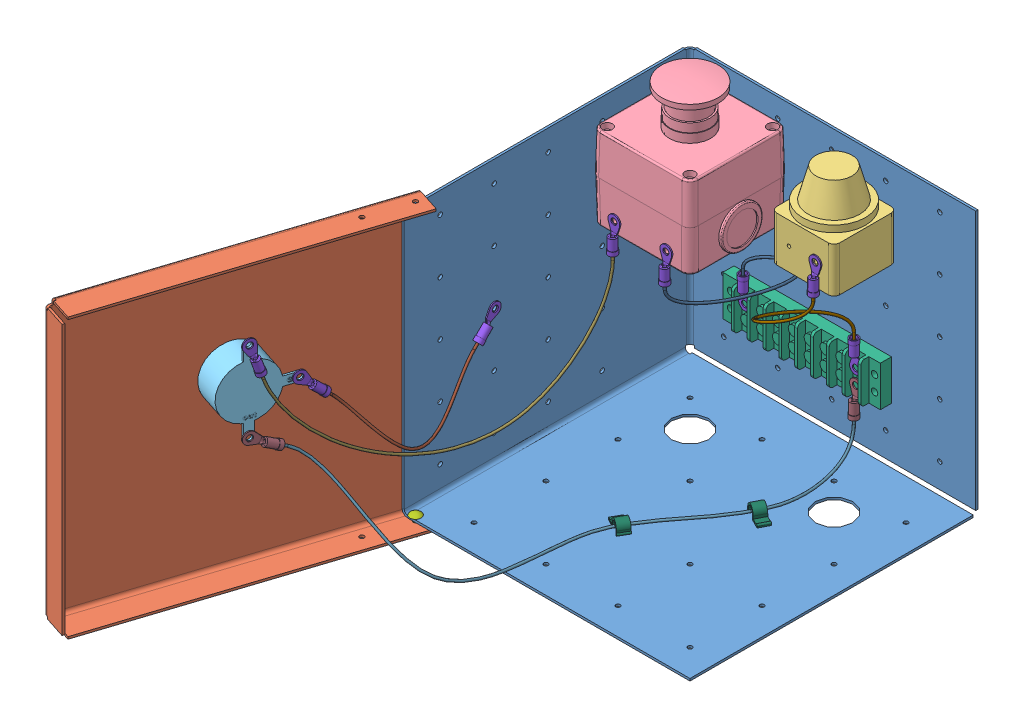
SolidWorks assembly Top Down.SLDASM, configuration Default (file format 13000). Lengths in mm.
Overall size (269.46 226.95 396.47).
29 component instances, 15 part files, 17 mates.
Components (placement in the parent):
- box10-1: box10.SLDPRT [Default] at origin size (203.2 186.37 203.2)
- cover_10-1: cover_10.SLDPRT [Default] at (96.159 -1254.76 -104.6335) x (-0.309017 0 0.951057) z (-0.951057 0 -0.309017) size (209.55 196.85 20.64)
- light_10-1: light_10.SLDPRT [Default] at (292.1 186.3725 177.8) x (-1 0 0) z (0 -1 0) size (44.45 44.45 58.74)
- E-StopSwitch_10-1: E-StopSwitch_10.SLDPRT [Default] at (50.8 157.9245 50.8) x (0 0 1) z (0 1 0) size (70 92.29 87.45)
- speed_control_10-1: speed_control_10.SLDPRT [Default] at (-14.2513 115.2525 296.8214) x (0.309017 0 -0.951057) z (0 1 0) size (51.5 40 62.97)
- SW3dPS-Terminal Block_10-2: SW3dPS-Terminal Block_10.SLDPRT [Default] at (143.764 67.6275 1.5875) x (-1 0 0) z (0 0 1) size (111.13 28.45 19.91)
- Pin_10-1: Pin_10.SLDPRT [Default] at (6.35 1.5875 200.025) size (7.94 14.29 7.94)
- Ring_0-6_10-1: Ring_0-6_10.sldasm [Default] at origin size (51.88 120.14 69.76)
  - ring_term_awg-14_10-15: ring_term_awg-14_10.SLDPRT [Default] at (129.032 58.7375 12.2873) x (0 1 0) z (1 0 0) size (27.02 6.1 8.38)
  - ring_term_awg-14_10-16: ring_term_awg-14_10.SLDPRT [Default] at (161.925 170.4975 73.8188) x (0 -1 0) z (-1 0 0) size (27.02 6.1 8.38)
  - Cable-Ring_0-6_10-1: Cable-Ring_0-6_10.sldprt [Default] at origin size (48.5 86.11 67.52)
- Ring_0-6-001_10-1: Ring_0-6-001_10.sldasm [Default] at origin size (46.9 86.58 83.6)
  - ring_term_awg-14_10-15: ring_term_awg-14_10.SLDPRT [Default] at (69.1868 136.9038 86.227) x (0 -0.999848 -0.017452) z (-1 0 0) size (27.02 6.1 8.38)
  - ring_term_awg-14_10-16: ring_term_awg-14_10.SLDPRT [Default] at (50.8 58.7375 12.2873) x (0 1 0) z (1 0 0) size (27.02 6.1 8.38)
  - Cable-Ring_0-6-001_10-1: Cable-Ring_0-6-001_10.sldprt [Default] at origin size (43.53 52.51 81.07)
- Ring_0-6-002_10-1: Ring_0-6-002_10.sldasm [Default] at origin size (37.51 61.07 143.29)
  - ring_term_awg-14_10-15: ring_term_awg-14_10.SLDPRT [Default] at (-4.7486 115.2525 270.1437) x (0.229644 -0.669131 -0.706773) z (-0.206773 -0.743145 0.636381) size (27.02 6.1 8.38)
  - ring_term_awg-14_10-16: ring_term_awg-14_10.SLDPRT [Default] at (2.3813 95.25 139.7) x (0 -0.707107 0.707107) z (0 0.707107 0.707107) size (27.02 6.1 8.38)
  - Cable-Ring_0-6-002_10-1: Cable-Ring_0-6-002_10.sldprt [Default] at origin size (30.63 47.17 113.8)
- Ring_1-0_10-1: Ring_1-0_10.sldasm [Default] at origin size (53.66 114.34 219.48)
  - ring_term_awg-14_10-15: ring_term_awg-14_10.SLDPRT [Default] at (-13.4964 143.5611 297.0667) x (0.095492 -0.951057 -0.293893) z (-0.293893 -0.309017 0.904508) size (27.02 6.1 8.38)
  - ring_term_awg-14_10-16: ring_term_awg-14_10.SLDPRT [Default] at (32.5019 136.9038 86.227) x (0 -0.999848 -0.017452) z (-1 0 0) size (27.02 6.1 8.38)
  - Cable_1-Ring_1-0_10-1: Cable_1-Ring_1-0_10.sldprt [Default] at origin size (45.47 97.11 208.44)
- Ring_1-3_10-1: Ring_1-3_10.sldasm [Default] at origin size (155.56 95.69 293.36)
  - ring_term_awg-14-16_awg-x 8_10-1: ring_term_awg-14-16_awg-x 8_10.sldprt [Default] at (-13.4964 86.9439 297.0667) x (0.275336 -0.45399 -0.847398) z (-0.140291 -0.891007 0.431771) size (27.02 6.1 8.38)
  - ring_term_awg-14-16_awg-x 8_10-2: ring_term_awg-14-16_awg-x 8_10.sldprt [Default] at (129.032 48.0695 12.2873) x (0 -1 0) z (-1 0 0) size (27.02 6.1 8.38)
  - Cable_1-Ring_1-3_10-1: Cable_1-Ring_1-3_10.sldprt [Default] at origin size (144.42 80.65 274.44)
  - richco_hurc-4-01-clip_10-1: richco_hurc-4-01-clip_10.sldprt [Default] at (88.4892 4.7625 136.779) x (0.866025 0 0.5) z (-0.5 0 0.866025) size (15.75 12.32 7.64)
  - richco_hurc-4-01-clip_10-2: richco_hurc-4-01-clip_10.sldprt [Default] at (127.2395 4.7625 79.4365) x (-0.891007 0 -0.45399) z (0.45399 0 -0.891007) size (15.75 12.32 7.64)
Mates (geometry in assembly coordinates):
- Concentric1: concentric aligned: cylinder of box10-1 through (6.35 0 200.025) axis (0 1 0) radius 1.5875; cylinder of cover_10-1 through (6.35 -3.81 200.025) axis (0 1 0) radius 1.5875
- Distance1: distance = 5.08 mm anti-aligned: line of box10-1 through (1.5875 186.3725 4.9213) axis (0 0 1); plane of cover_10-1 through (-66.256 191.4525 390.091) normal (0 -1 0)
- Coincident3: coincident anti-aligned: line of box10-1 through (1.5875 186.3725 4.9213) axis (0 0 1); plane of E-StopSwitch_10-1 through (15.8 186.3725 15.8) normal (0 1 0)
- Concentric3: concentric aligned: cylinder of box10-1 through (50.8 0 50.8) axis (0 -1 0) radius 13.081; cylinder of E-StopSwitch_10-1 through (50.8 192.4685 50.8) axis (0 -1 0) radius 14.5415
- Coincident5: coincident anti-aligned: line of box10-1 through (203.2 186.3725 1.5875) axis (-1 0 0); plane of light_10-1 through (133.985 186.3725 32.385) normal (0 1 0)
- Concentric4: concentric aligned: cylinder of box10-1 through (152.4 0 50.8) axis (0 -1 0) radius 13.081; cylinder of light_10-1 through (152.4 186.3725 50.8) axis (0 -1 0) radius 22.225
- Parallel2: parallel anti-aligned: plane of light_10-1 through (133.985 154.6225 28.575) normal (0 0 -1); plane of box10-1 through (203.2 0 1.5875) normal (0 0 1)
- Coincident7: coincident anti-aligned: plane of cover_10-1 through (0.0083 -3.81 191.2877) normal (0.951057 0 0.309017); plane of speed_control_10-1 through (-32.3689 115.2525 290.9346) normal (-0.951057 0 -0.309017)
- Concentric5: concentric anti-aligned: cylinder of cover_10-1 through (-33.8787 115.2525 290.4441) axis (-0.951057 0 -0.309017) radius 4.7625; cylinder of speed_control_10-1 through (-50.4865 115.2525 285.0479) axis (0.951057 0 0.309017) radius 3.048
- Parallel6: parallel aligned: plane of speed_control_10-1 through (-14.478 143.5611 293.4094) normal (0.309017 0 -0.951057); line of cover_10-1 through (-46.6285 -0.4264 396.4684) axis (0 1 0)
- Angle1: planar angle = 0.314159 rad aligned: plane of box10-1 through (0 190.5 203.2) normal (-1 0 0); plane of cover_10-1 through (-1.5015 -3.81 190.7971) normal (-0.951057 0 -0.309017)
- Parallel4: parallel: plane of box10-1 through (1.5875 190.5 203.2) normal (1 0 0); line of E-StopSwitch_10-1 through (85.8 157.9245 80.2636) axis (0 0 -1)
- Coincident142: coincident anti-aligned: plane of box10-1 through (203.2 0 1.5875) normal (0 0 1); plane of SW3dPS-Terminal Block_10-2 through (143.764 67.6275 1.5875) normal (0 0 -1)
- Parallel5: parallel: line of box10-1 through (203.2 3.3836 1.5875) axis (0 1 0); plane of SW3dPS-Terminal Block_10-2 through (143.764 67.6275 9.4615) normal (1 0 0)
- Concentric6: concentric aligned: cylinder of box10-1 through (139.7 58.7375 1.5875) axis (0 0 1) radius 1.5875; cylinder of SW3dPS-Terminal Block_10-2 through (139.7 58.7375 1.5875) axis (0 0 1) radius 2.286
- Concentric8: concentric aligned: cylinder of box10-1 through (6.35 0 200.025) axis (0 1 0) radius 1.5875; cylinder of Pin_10-1 through (6.35 5.1195 200.025) axis (0 1 0) radius 1.397
- Coincident144: coincident anti-aligned: plane of box10-1 through (0 1.5875 203.2) normal (0 1 0); plane of Pin_10-1 through (7.747 1.5875 200.025) normal (0 -1 0)
